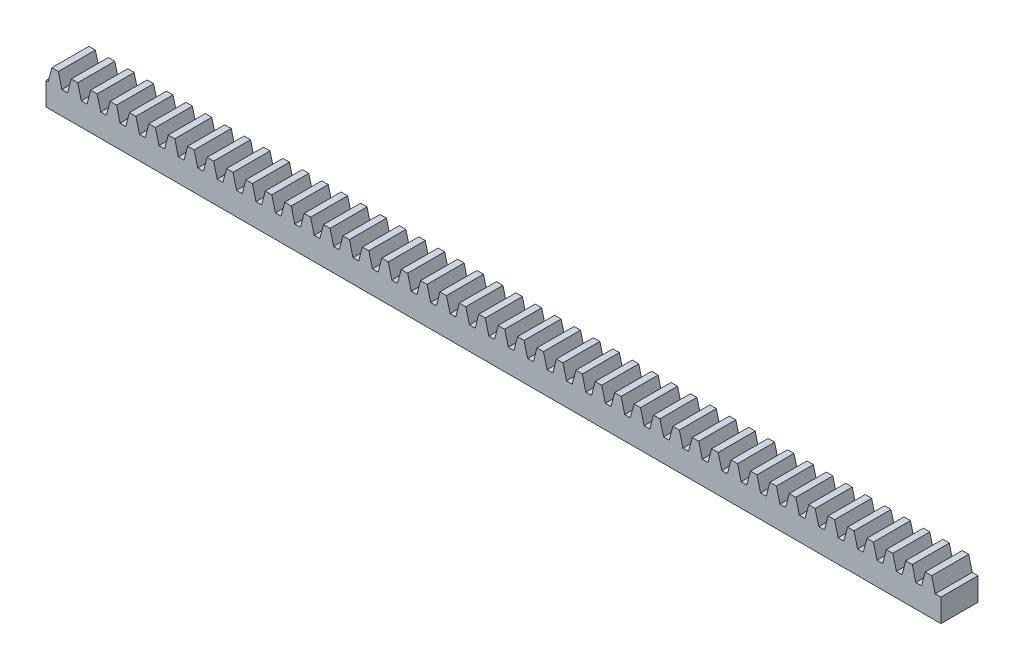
from build123d import *

# Parameters (mm, degrees)
BASE_EXTRUDE_DEPTH = 6.35


with BuildPart() as part:
    # Sketch1 → Base-Extrude (new body)
    with BuildSketch(Plane.XY):
        Polygon((0, 3.94462), (0, 0), (153.32456, 0), (153.32456, 3.94462), (152.3440184, 3.94462), (151.7285256, 6.3246), (150.6151928, 6.3246), (149.9997, 3.94462), (149.0191584, 3.94462), (148.4036656, 6.3246), (147.2903328, 6.3246), (146.67484, 3.94462), (145.6942984, 3.94462), (145.0788056, 6.3246), (143.9654728, 6.3246), (143.34998, 3.94462), (142.3694384, 3.94462), (141.7539456, 6.3246), (140.6406128, 6.3246), (140.02512, 3.94462), (139.0445784, 3.94462), (138.4290856, 6.3246), (137.3157528, 6.3246), (136.70026, 3.94462), (135.7197184, 3.94462), (135.1042256, 6.3246), (133.9908928, 6.3246), (133.3754, 3.94462), (132.3948584, 3.94462), (131.7793656, 6.3246), (130.6660328, 6.3246), (130.05054, 3.94462), (129.0699984, 3.94462), (128.4545056, 6.3246), (127.3411728, 6.3246), (126.72568, 3.94462), (125.7451384, 3.94462), (125.1296456, 6.3246), (124.0163128, 6.3246), (123.40082, 3.94462), (122.4202784, 3.94462), (121.8047856, 6.3246), (120.6914528, 6.3246), (120.07596, 3.94462), (119.0954184, 3.94462), (118.4799256, 6.3246), (117.3665928, 6.3246), (116.7511, 3.94462), (115.7705584, 3.94462), (115.1550656, 6.3246), (114.0417328, 6.3246), (113.42624, 3.94462), (112.4456984, 3.94462), (111.8302056, 6.3246), (110.7168728, 6.3246), (110.10138, 3.94462), (109.1208384, 3.94462), (108.5053456, 6.3246), (107.3920128, 6.3246), (106.77652, 3.94462), (105.7959784, 3.94462), (105.1804856, 6.3246), (104.0671528, 6.3246), (103.45166, 3.94462), (102.4711184, 3.94462), (101.8556256, 6.3246), (100.7422928, 6.3246), (100.1268, 3.94462), (99.1462584, 3.94462), (98.5307656, 6.3246), (97.4174328, 6.3246), (96.80194, 3.94462), (95.8213984, 3.94462), (95.2059056, 6.3246), (94.0925728, 6.3246), (93.47708, 3.94462), (92.4965384, 3.94462), (91.8810456, 6.3246), (90.7677128, 6.3246), (90.15222, 3.94462), (89.1716784, 3.94462), (88.5561856, 6.3246), (87.4428528, 6.3246), (86.82736, 3.94462), (85.8468184, 3.94462), (85.2313256, 6.3246), (84.1179928, 6.3246), (83.5025, 3.94462), (82.5219584, 3.94462), (81.9064656, 6.3246), (80.7931328, 6.3246), (80.17764, 3.94462), (79.1970984, 3.94462), (78.5816056, 6.3246), (77.4682728, 6.3246), (76.85278, 3.94462), (75.8722384, 3.94462), (75.2567456, 6.3246), (74.1434128, 6.3246), (73.52792, 3.94462), (72.5473784, 3.94462), (71.9318856, 6.3246), (70.8185528, 6.3246), (70.20306, 3.94462), (69.2225184, 3.94462), (68.6070256, 6.3246), (67.4936928, 6.3246), (66.8782, 3.94462), (65.8976584, 3.94462), (65.2821656, 6.3246), (64.1688328, 6.3246), (63.55334, 3.94462), (62.5727984, 3.94462), (61.9573056, 6.3246), (60.8439728, 6.3246), (60.22848, 3.94462), (59.2479384, 3.94462), (58.6324456, 6.3246), (57.5191128, 6.3246), (56.90362, 3.94462), (55.9230784, 3.94462), (55.3075856, 6.3246), (54.1942528, 6.3246), (53.57876, 3.94462), (52.5982184, 3.94462), (51.9827256, 6.3246), (50.8693928, 6.3246), (50.2539, 3.94462), (49.2733584, 3.94462), (48.6578656, 6.3246), (47.5445328, 6.3246), (46.92904, 3.94462), (45.9484984, 3.94462), (45.3330056, 6.3246), (44.2196728, 6.3246), (43.60418, 3.94462), (42.6236384, 3.94462), (42.0081456, 6.3246), (40.8948128, 6.3246), (40.27932, 3.94462), (39.2987784, 3.94462), (38.6832856, 6.3246), (37.5699528, 6.3246), (36.95446, 3.94462), (35.9739184, 3.94462), (35.3584256, 6.3246), (34.2450928, 6.3246), (33.6296, 3.94462), (32.6490584, 3.94462), (32.0335656, 6.3246), (30.9202328, 6.3246), (30.30474, 3.94462), (29.3241984, 3.94462), (28.7087056, 6.3246), (27.5953728, 6.3246), (26.97988, 3.94462), (25.9993384, 3.94462), (25.3838456, 6.3246), (24.2705128, 6.3246), (23.65502, 3.94462), (22.6744784, 3.94462), (22.0589856, 6.3246), (20.9456528, 6.3246), (20.33016, 3.94462), (19.3496184, 3.94462), (18.7341256, 6.3246), (17.6207928, 6.3246), (17.0053, 3.94462), (16.0247584, 3.94462), (15.4092656, 6.3246), (14.2959328, 6.3246), (13.68044, 3.94462), (12.6998984, 3.94462), (12.0844056, 6.3246), (10.9710728, 6.3246), (10.35558, 3.94462), (9.3750384, 3.94462), (8.7595456, 6.3246), (7.6462128, 6.3246), (7.03072, 3.94462), (6.0501784, 3.94462), (5.4346856, 6.3246), (4.3213528, 6.3246), (3.70586, 3.94462), (2.7253184, 3.94462), (2.1098256, 6.3246), (0.9964928, 6.3246), (0.381, 3.94462), align=None)
    extrude(amount=-BASE_EXTRUDE_DEPTH)


solid = part.part
